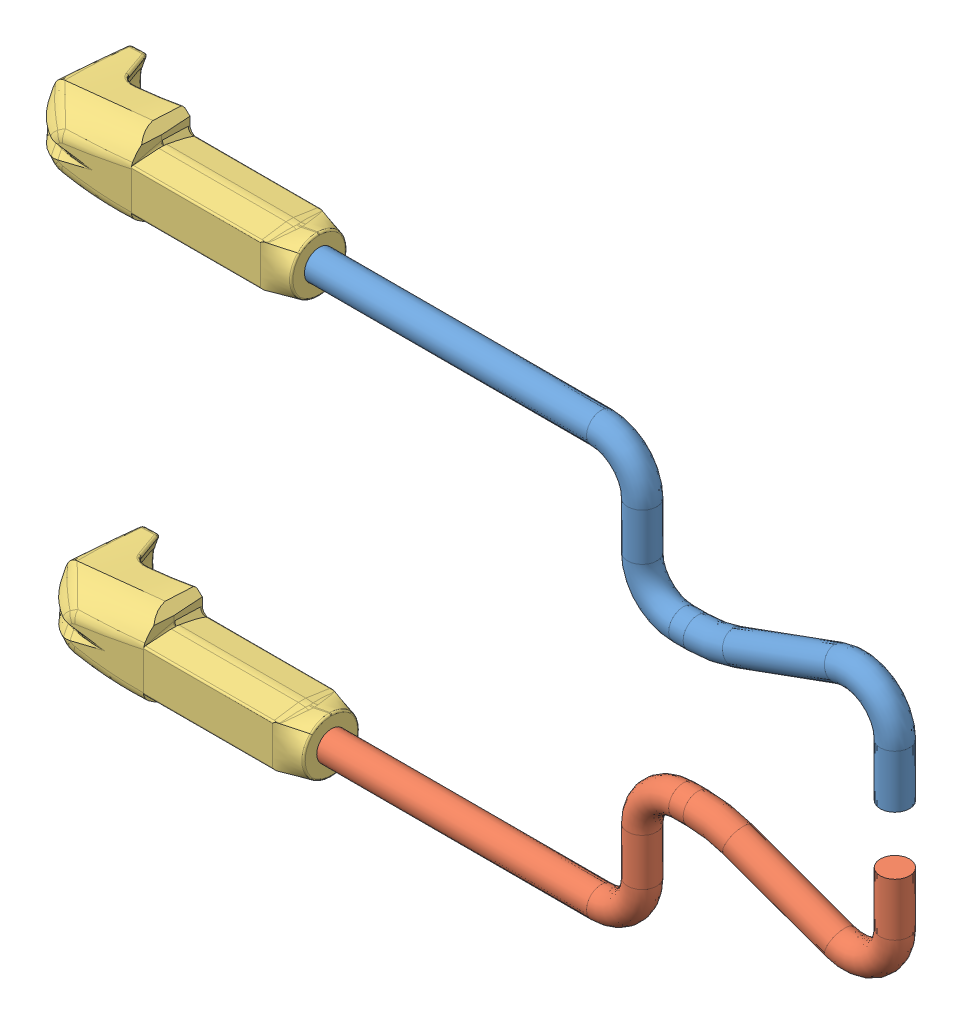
SolidWorks assembly Assemblage branche droite.SLDASM, configuration Défaut (file format 4400). Lengths in mm.
Overall size (144.78 75 36.49).
4 component instances, 3 part files, 10 mates.
Components (placement in the parent):
- branche frein 3p  droite-1: branche frein 3p  droite.SLDPRT [Défaut] at origin size (144.78 32.56 21.69)
- branche frein 3p gauche-1: branche frein 3p gauche.SLDPRT [Défaut] at (0 -70 0) x (1 0 0) z (0 0 -1) size (139.85 32.56 36.49)
- 650880000-SURMOU_DROIT_STD_F03-1: 650880000-SURMOU_DROIT_STD_F03.SLDPRT [Défaut] at (-6.9766 -113.5 0) x (1 0 0) z (0 1 0)
- 650880000-SURMOU_DROIT_STD_F03-2: 650880000-SURMOU_DROIT_STD_F03.SLDPRT [Défaut] at (-9.074 -43.6 0) x (1 0 0) z (0 1 0)
Mates (geometry in assembly coordinates):
- Coïncidente11: coincident aligned: plane of branche frein 3p  droite-1; plane of branche frein 3p gauche-1
- Distance1: distance = 70 mm anti-aligned: plane of branche frein 3p  droite-1; plane of branche frein 3p gauche-1
- Coïncidente3: coincident anti-aligned: plane of branche frein 3p  droite-1; plane of branche frein 3p gauche-1
- Coïncidente7: coincident: axis of 650880000-SURMOU_DROIT_STD_F03-1 through (-84.124 -70 0) axis (1 0 0); plane of branche frein 3p gauche-1
- Distance5: distance = 43.6 mm aligned: plane of branche frein 3p  droite-1; plane of 650880000-SURMOU_DROIT_STD_F03-2
- Coïncidente8: coincident anti-aligned: plane of 650880000-SURMOU_DROIT_STD_F03-2; plane of assembly
- Coïncidente10: coincident anti-aligned: plane of 650880000-SURMOU_DROIT_STD_F03-1; plane of assembly
- Parallèle2: parallel aligned: plane of branche frein 3p  droite-1; plane of 650880000-SURMOU_DROIT_STD_F03-1
- Parallèle3: parallel aligned: 
- PLAN1: unknown = 139.6263 mm: line of branche frein 3p gauche-1 through (0 -63 0) axis (0 1 0)
